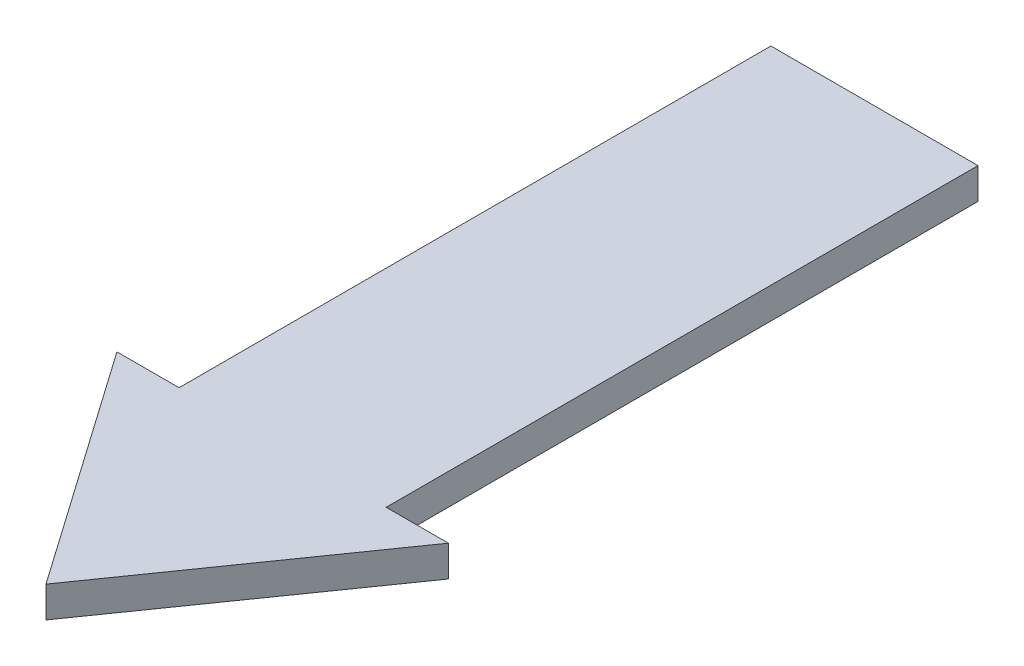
from build123d import *

# Parameters (mm, degrees)
AUFSATZ_LIN_GK_DEPTH = 15


with BuildPart() as part:
    # L_ u Br → Aufsatz-Lin_GK (new body)
    with BuildSketch(Plane(origin=(0, 0, 0), x_dir=(1, 0, 0), z_dir=(0, 1, 0))):
        Polygon((0, 0), (0, 400), (-50, 400), (-50, 114.251840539), (-80, 114.251840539), align=None)
    extrude(amount=AUFSATZ_LIN_GK_DEPTH)

    # Spiegeln_Rechts: part across plane


with BuildPart() as part_1:
    add(part.part)
    add(part.part.mirror(Plane(origin=(0, 0, 0), x_dir=(0, 0, 1), z_dir=(1, 0, 0))))


solid = part_1.part
